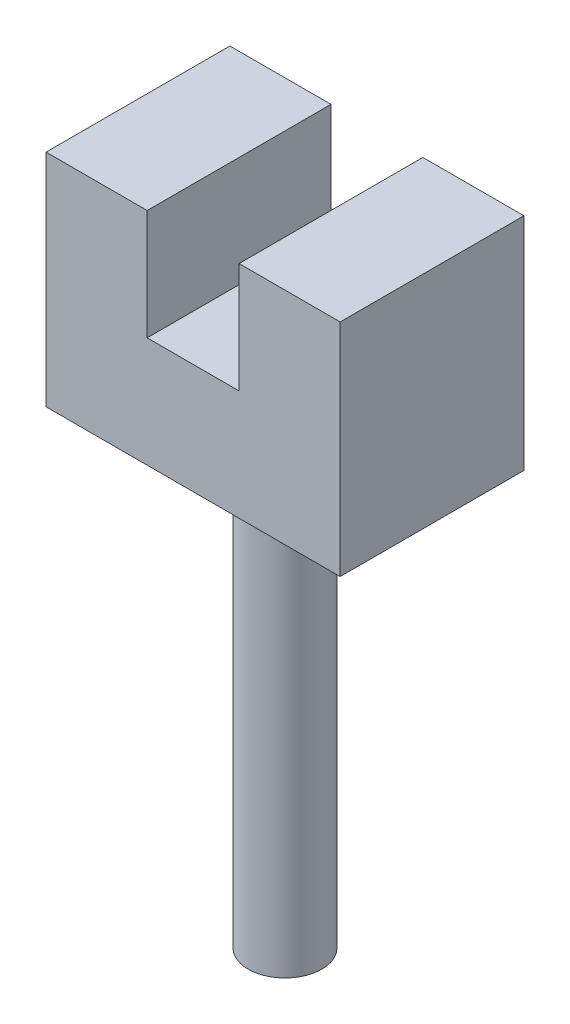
ISO-10303-21;
HEADER;
FILE_DESCRIPTION(('STEP AP214'),'2;1');
FILE_NAME('part.step','',(''),(''),'','','');
FILE_SCHEMA(('AUTOMOTIVE_DESIGN { 1 0 10303 214 1 1 1 1 }'));
ENDSEC;
DATA;
#1=APPLICATION_CONTEXT('core data for automotive mechanical design processes');
#2=APPLICATION_PROTOCOL_DEFINITION('international standard','automotive_design',2000,#1);
#3=PRODUCT_CONTEXT('',#1,'mechanical');
#4=PRODUCT('Part','Part','',(#3));
#5=PRODUCT_RELATED_PRODUCT_CATEGORY('part','',(#4));
#6=PRODUCT_DEFINITION_FORMATION('','',#4);
#7=PRODUCT_DEFINITION_CONTEXT('part definition',#1,'design');
#8=PRODUCT_DEFINITION('design','',#6,#7);
#9=PRODUCT_DEFINITION_SHAPE('','',#8);
#10=(LENGTH_UNIT() NAMED_UNIT(*) SI_UNIT(.MILLI.,.METRE.));
#11=(NAMED_UNIT(*) PLANE_ANGLE_UNIT() SI_UNIT($,.RADIAN.));
#12=(NAMED_UNIT(*) SI_UNIT($,.STERADIAN.) SOLID_ANGLE_UNIT());
#13=UNCERTAINTY_MEASURE_WITH_UNIT(LENGTH_MEASURE(1.E-05),#10,'distance_accuracy_value','');
#14=(GEOMETRIC_REPRESENTATION_CONTEXT(3) GLOBAL_UNCERTAINTY_ASSIGNED_CONTEXT((#13)) GLOBAL_UNIT_ASSIGNED_CONTEXT((#10,
#11,#12)) REPRESENTATION_CONTEXT('',''));
#15=CARTESIAN_POINT('',(0.,0.,0.));
#16=DIRECTION('',(0.,0.,1.));
#17=DIRECTION('',(1.,0.,0.));
#18=AXIS2_PLACEMENT_3D('',#15,#16,#17);
#19=CARTESIAN_POINT('',(0.,-38.1,0.));
#20=DIRECTION('',(0.,0.,1.));
#21=DIRECTION('',(1.,0.,0.));
#22=AXIS2_PLACEMENT_3D('',#19,#20,#21);
#23=PLANE('',#22);
#24=DIRECTION('',(1.,0.,0.));
#25=VECTOR('',#24,1.);
#26=CARTESIAN_POINT('',(0.,0.,0.));
#27=LINE('',#26,#25);
#28=CARTESIAN_POINT('',(33.3375,0.,0.));
#29=VERTEX_POINT('',#28);
#30=CARTESIAN_POINT('',(50.8,0.,0.));
#31=VERTEX_POINT('',#30);
#32=EDGE_CURVE('E138',#29,#31,#27,.T.);
#33=ORIENTED_EDGE('',*,*,#32,.F.);
#34=DIRECTION('',(0.,1.,0.));
#35=VECTOR('',#34,1.);
#36=CARTESIAN_POINT('',(33.3375,-19.05,0.));
#37=LINE('',#36,#35);
#38=CARTESIAN_POINT('',(33.3375,-19.05,0.));
#39=VERTEX_POINT('',#38);
#40=EDGE_CURVE('E136',#39,#29,#37,.T.);
#41=ORIENTED_EDGE('',*,*,#40,.F.);
#42=DIRECTION('',(1.,0.,0.));
#43=VECTOR('',#42,1.);
#44=CARTESIAN_POINT('',(0.,-19.05,0.));
#45=LINE('',#44,#43);
#46=CARTESIAN_POINT('',(17.4625,-19.05,0.));
#47=VERTEX_POINT('',#46);
#48=EDGE_CURVE('E115',#47,#39,#45,.T.);
#49=ORIENTED_EDGE('',*,*,#48,.F.);
#50=DIRECTION('',(0.,1.,0.));
#51=VECTOR('',#50,1.);
#52=CARTESIAN_POINT('',(17.4625,-19.05,0.));
#53=LINE('',#52,#51);
#54=CARTESIAN_POINT('',(17.4625,0.,0.));
#55=VERTEX_POINT('',#54);
#56=EDGE_CURVE('E139',#47,#55,#53,.T.);
#57=ORIENTED_EDGE('',*,*,#56,.T.);
#58=CARTESIAN_POINT('',(0.,0.,0.));
#59=VERTEX_POINT('',#58);
#60=EDGE_CURVE('E152',#59,#55,#27,.T.);
#61=ORIENTED_EDGE('',*,*,#60,.F.);
#62=DIRECTION('',(0.,1.,0.));
#63=VECTOR('',#62,1.);
#64=CARTESIAN_POINT('',(0.,-38.1,0.));
#65=LINE('',#64,#63);
#66=CARTESIAN_POINT('',(0.,-38.1,0.));
#67=VERTEX_POINT('',#66);
#68=EDGE_CURVE('E40',#67,#59,#65,.T.);
#69=ORIENTED_EDGE('',*,*,#68,.F.);
#70=DIRECTION('',(1.,0.,0.));
#71=VECTOR('',#70,1.);
#72=CARTESIAN_POINT('',(0.,-38.1,0.));
#73=LINE('',#72,#71);
#74=CARTESIAN_POINT('',(50.8,-38.1,0.));
#75=VERTEX_POINT('',#74);
#76=EDGE_CURVE('E143',#67,#75,#73,.T.);
#77=ORIENTED_EDGE('',*,*,#76,.T.);
#78=DIRECTION('',(0.,1.,0.));
#79=VECTOR('',#78,1.);
#80=CARTESIAN_POINT('',(50.8,-38.1,0.));
#81=LINE('',#80,#79);
#82=EDGE_CURVE('E81',#75,#31,#81,.T.);
#83=ORIENTED_EDGE('',*,*,#82,.T.);
#84=EDGE_LOOP('',(#33,#41,#49,#57,#61,#69,#77,#83));
#85=FACE_BOUND('',#84,.T.);
#86=ADVANCED_FACE('F33',(#85),#23,.T.);
#87=CARTESIAN_POINT('',(0.,-38.1,-31.75));
#88=DIRECTION('',(0.,0.,1.));
#89=DIRECTION('',(1.,0.,0.));
#90=AXIS2_PLACEMENT_3D('',#87,#88,#89);
#91=PLANE('',#90);
#92=DIRECTION('',(0.,1.,0.));
#93=VECTOR('',#92,1.);
#94=CARTESIAN_POINT('',(33.3375,-19.05,-31.75));
#95=LINE('',#94,#93);
#96=CARTESIAN_POINT('',(33.3375,-19.05,-31.75));
#97=VERTEX_POINT('',#96);
#98=CARTESIAN_POINT('',(33.3375,0.,-31.75));
#99=VERTEX_POINT('',#98);
#100=EDGE_CURVE('E105',#97,#99,#95,.T.);
#101=ORIENTED_EDGE('',*,*,#100,.T.);
#102=DIRECTION('',(1.,0.,0.));
#103=VECTOR('',#102,1.);
#104=CARTESIAN_POINT('',(0.,0.,-31.75));
#105=LINE('',#104,#103);
#106=CARTESIAN_POINT('',(50.8,0.,-31.75));
#107=VERTEX_POINT('',#106);
#108=EDGE_CURVE('E158',#99,#107,#105,.T.);
#109=ORIENTED_EDGE('',*,*,#108,.T.);
#110=DIRECTION('',(0.,1.,0.));
#111=VECTOR('',#110,1.);
#112=CARTESIAN_POINT('',(50.8,-38.1,-31.75));
#113=LINE('',#112,#111);
#114=CARTESIAN_POINT('',(50.8,-38.1,-31.75));
#115=VERTEX_POINT('',#114);
#116=EDGE_CURVE('E166',#115,#107,#113,.T.);
#117=ORIENTED_EDGE('',*,*,#116,.F.);
#118=DIRECTION('',(1.,0.,0.));
#119=VECTOR('',#118,1.);
#120=CARTESIAN_POINT('',(0.,-38.1,-31.75));
#121=LINE('',#120,#119);
#122=CARTESIAN_POINT('',(0.,-38.1,-31.75));
#123=VERTEX_POINT('',#122);
#124=EDGE_CURVE('E148',#123,#115,#121,.T.);
#125=ORIENTED_EDGE('',*,*,#124,.F.);
#126=DIRECTION('',(0.,1.,0.));
#127=VECTOR('',#126,1.);
#128=CARTESIAN_POINT('',(0.,-38.1,-31.75));
#129=LINE('',#128,#127);
#130=CARTESIAN_POINT('',(0.,0.,-31.75));
#131=VERTEX_POINT('',#130);
#132=EDGE_CURVE('E163',#123,#131,#129,.T.);
#133=ORIENTED_EDGE('',*,*,#132,.T.);
#134=CARTESIAN_POINT('',(17.4625,0.,-31.75));
#135=VERTEX_POINT('',#134);
#136=EDGE_CURVE('E159',#131,#135,#105,.T.);
#137=ORIENTED_EDGE('',*,*,#136,.T.);
#138=DIRECTION('',(0.,1.,0.));
#139=VECTOR('',#138,1.);
#140=CARTESIAN_POINT('',(17.4625,-19.05,-31.75));
#141=LINE('',#140,#139);
#142=CARTESIAN_POINT('',(17.4625,-19.05,-31.75));
#143=VERTEX_POINT('',#142);
#144=EDGE_CURVE('E47',#143,#135,#141,.T.);
#145=ORIENTED_EDGE('',*,*,#144,.F.);
#146=DIRECTION('',(1.,0.,0.));
#147=VECTOR('',#146,1.);
#148=CARTESIAN_POINT('',(0.,-19.05,-31.75));
#149=LINE('',#148,#147);
#150=EDGE_CURVE('E120',#143,#97,#149,.T.);
#151=ORIENTED_EDGE('',*,*,#150,.T.);
#152=EDGE_LOOP('',(#101,#109,#117,#125,#133,#137,#145,#151));
#153=FACE_BOUND('',#152,.T.);
#154=ADVANCED_FACE('F125',(#153),#91,.F.);
#155=CARTESIAN_POINT('',(0.,0.,0.));
#156=DIRECTION('',(0.,1.,0.));
#157=DIRECTION('',(0.,0.,1.));
#158=AXIS2_PLACEMENT_3D('',#155,#156,#157);
#159=PLANE('',#158);
#160=ORIENTED_EDGE('',*,*,#108,.F.);
#161=DIRECTION('',(0.,0.,1.));
#162=VECTOR('',#161,1.);
#163=CARTESIAN_POINT('',(33.3375,0.,0.));
#164=LINE('',#163,#162);
#165=EDGE_CURVE('E111',#99,#29,#164,.T.);
#166=ORIENTED_EDGE('',*,*,#165,.T.);
#167=ORIENTED_EDGE('',*,*,#32,.T.);
#168=DIRECTION('',(0.,0.,-1.));
#169=VECTOR('',#168,1.);
#170=CARTESIAN_POINT('',(50.8,0.,0.));
#171=LINE('',#170,#169);
#172=EDGE_CURVE('E155',#31,#107,#171,.T.);
#173=ORIENTED_EDGE('',*,*,#172,.T.);
#174=EDGE_LOOP('',(#160,#166,#167,#173));
#175=FACE_BOUND('',#174,.T.);
#176=ADVANCED_FACE('F173',(#175),#159,.T.);
#177=CARTESIAN_POINT('',(0.,-38.1,0.));
#178=DIRECTION('',(1.,0.,0.));
#179=DIRECTION('',(0.,0.,-1.));
#180=AXIS2_PLACEMENT_3D('',#177,#178,#179);
#181=PLANE('',#180);
#182=DIRECTION('',(0.,0.,-1.));
#183=VECTOR('',#182,1.);
#184=CARTESIAN_POINT('',(0.,0.,0.));
#185=LINE('',#184,#183);
#186=EDGE_CURVE('E146',#59,#131,#185,.T.);
#187=ORIENTED_EDGE('',*,*,#186,.T.);
#188=ORIENTED_EDGE('',*,*,#132,.F.);
#189=DIRECTION('',(0.,0.,-1.));
#190=VECTOR('',#189,1.);
#191=CARTESIAN_POINT('',(0.,-38.1,0.));
#192=LINE('',#191,#190);
#193=EDGE_CURVE('E150',#67,#123,#192,.T.);
#194=ORIENTED_EDGE('',*,*,#193,.F.);
#195=ORIENTED_EDGE('',*,*,#68,.T.);
#196=EDGE_LOOP('',(#187,#188,#194,#195));
#197=FACE_BOUND('',#196,.T.);
#198=ADVANCED_FACE('F178',(#197),#181,.F.);
#199=CARTESIAN_POINT('',(50.8,-38.1,0.));
#200=DIRECTION('',(1.,0.,0.));
#201=DIRECTION('',(0.,0.,-1.));
#202=AXIS2_PLACEMENT_3D('',#199,#200,#201);
#203=PLANE('',#202);
#204=ORIENTED_EDGE('',*,*,#172,.F.);
#205=ORIENTED_EDGE('',*,*,#82,.F.);
#206=DIRECTION('',(0.,0.,-1.));
#207=VECTOR('',#206,1.);
#208=CARTESIAN_POINT('',(50.8,-38.1,0.));
#209=LINE('',#208,#207);
#210=EDGE_CURVE('E145',#75,#115,#209,.T.);
#211=ORIENTED_EDGE('',*,*,#210,.T.);
#212=ORIENTED_EDGE('',*,*,#116,.T.);
#213=EDGE_LOOP('',(#204,#205,#211,#212));
#214=FACE_BOUND('',#213,.T.);
#215=ADVANCED_FACE('F170',(#214),#203,.T.);
#216=CARTESIAN_POINT('',(0.,-38.1,0.));
#217=DIRECTION('',(0.,1.,0.));
#218=DIRECTION('',(0.,0.,1.));
#219=AXIS2_PLACEMENT_3D('',#216,#217,#218);
#220=PLANE('',#219);
#221=CARTESIAN_POINT('',(25.4,-38.1,-15.875));
#222=DIRECTION('',(0.,1.,0.));
#223=DIRECTION('',(0.,0.,1.));
#224=AXIS2_PLACEMENT_3D('',#221,#222,#223);
#225=CIRCLE('',#224,6.35);
#226=CARTESIAN_POINT('',(25.4,-38.1,-9.525));
#227=VERTEX_POINT('',#226);
#228=EDGE_CURVE('E11',#227,#227,#225,.F.);
#229=ORIENTED_EDGE('',*,*,#228,.F.);
#230=EDGE_LOOP('',(#229));
#231=FACE_BOUND('',#230,.T.);
#232=ORIENTED_EDGE('',*,*,#76,.F.);
#233=ORIENTED_EDGE('',*,*,#193,.T.);
#234=ORIENTED_EDGE('',*,*,#124,.T.);
#235=ORIENTED_EDGE('',*,*,#210,.F.);
#236=EDGE_LOOP('',(#232,#233,#234,#235));
#237=FACE_BOUND('',#236,.T.);
#238=ADVANCED_FACE('F176',(#231,#237),#220,.F.);
#239=DIRECTION('',(0.,0.,1.));
#240=VECTOR('',#239,1.);
#241=CARTESIAN_POINT('',(17.4625,0.,0.));
#242=LINE('',#241,#240);
#243=EDGE_CURVE('E123',#135,#55,#242,.T.);
#244=ORIENTED_EDGE('',*,*,#243,.F.);
#245=ORIENTED_EDGE('',*,*,#136,.F.);
#246=ORIENTED_EDGE('',*,*,#186,.F.);
#247=ORIENTED_EDGE('',*,*,#60,.T.);
#248=EDGE_LOOP('',(#244,#245,#246,#247));
#249=FACE_BOUND('',#248,.T.);
#250=ADVANCED_FACE('F181',(#249),#159,.T.);
#251=CARTESIAN_POINT('',(33.3375,-19.05,0.));
#252=DIRECTION('',(-1.,0.,0.));
#253=DIRECTION('',(0.,0.,1.));
#254=AXIS2_PLACEMENT_3D('',#251,#252,#253);
#255=PLANE('',#254);
#256=ORIENTED_EDGE('',*,*,#165,.F.);
#257=ORIENTED_EDGE('',*,*,#100,.F.);
#258=DIRECTION('',(0.,0.,1.));
#259=VECTOR('',#258,1.);
#260=CARTESIAN_POINT('',(33.3375,-19.05,0.));
#261=LINE('',#260,#259);
#262=EDGE_CURVE('E108',#97,#39,#261,.T.);
#263=ORIENTED_EDGE('',*,*,#262,.T.);
#264=ORIENTED_EDGE('',*,*,#40,.T.);
#265=EDGE_LOOP('',(#256,#257,#263,#264));
#266=FACE_BOUND('',#265,.T.);
#267=ADVANCED_FACE('F107',(#266),#255,.T.);
#268=CARTESIAN_POINT('',(17.4625,-19.05,0.));
#269=DIRECTION('',(-1.,0.,0.));
#270=DIRECTION('',(0.,0.,1.));
#271=AXIS2_PLACEMENT_3D('',#268,#269,#270);
#272=PLANE('',#271);
#273=ORIENTED_EDGE('',*,*,#243,.T.);
#274=ORIENTED_EDGE('',*,*,#56,.F.);
#275=DIRECTION('',(0.,0.,1.));
#276=VECTOR('',#275,1.);
#277=CARTESIAN_POINT('',(17.4625,-19.05,0.));
#278=LINE('',#277,#276);
#279=EDGE_CURVE('E127',#143,#47,#278,.T.);
#280=ORIENTED_EDGE('',*,*,#279,.F.);
#281=ORIENTED_EDGE('',*,*,#144,.T.);
#282=EDGE_LOOP('',(#273,#274,#280,#281));
#283=FACE_BOUND('',#282,.T.);
#284=ADVANCED_FACE('F182',(#283),#272,.F.);
#285=CARTESIAN_POINT('',(0.,-19.05,0.));
#286=DIRECTION('',(0.,1.,0.));
#287=DIRECTION('',(0.,0.,1.));
#288=AXIS2_PLACEMENT_3D('',#285,#286,#287);
#289=PLANE('',#288);
#290=ORIENTED_EDGE('',*,*,#262,.F.);
#291=ORIENTED_EDGE('',*,*,#150,.F.);
#292=ORIENTED_EDGE('',*,*,#279,.T.);
#293=ORIENTED_EDGE('',*,*,#48,.T.);
#294=EDGE_LOOP('',(#290,#291,#292,#293));
#295=FACE_BOUND('',#294,.T.);
#296=ADVANCED_FACE('F118',(#295),#289,.T.);
#297=CARTESIAN_POINT('',(25.4,-114.3,-15.875));
#298=DIRECTION('',(0.,1.,0.));
#299=DIRECTION('',(0.,0.,1.));
#300=AXIS2_PLACEMENT_3D('',#297,#298,#299);
#301=CYLINDRICAL_SURFACE('',#300,6.35);
#302=CARTESIAN_POINT('',(25.4,-114.3,-15.875));
#303=DIRECTION('',(0.,-1.,0.));
#304=DIRECTION('',(0.,0.,-1.));
#305=AXIS2_PLACEMENT_3D('',#302,#303,#304);
#306=CIRCLE('',#305,6.35);
#307=CARTESIAN_POINT('',(25.4,-114.3,-9.525));
#308=VERTEX_POINT('',#307);
#309=EDGE_CURVE('E134',#308,#308,#306,.T.);
#310=CARTESIAN_POINT('',(25.4,-114.3,-9.525));
#311=CARTESIAN_POINT('',(25.4,-113.50625,-9.525));
#312=CARTESIAN_POINT('',(25.4,-112.7125,-9.525));
#313=CARTESIAN_POINT('',(25.4,-111.125,-9.525));
#314=CARTESIAN_POINT('',(25.4,-110.33125,-9.525));
#315=CARTESIAN_POINT('',(25.4,-108.74375,-9.525));
#316=CARTESIAN_POINT('',(25.4,-107.95,-9.525));
#317=CARTESIAN_POINT('',(25.4,-106.3625,-9.525));
#318=CARTESIAN_POINT('',(25.4,-105.56875,-9.525));
#319=CARTESIAN_POINT('',(25.4,-103.98125,-9.525));
#320=CARTESIAN_POINT('',(25.4,-103.1875,-9.525));
#321=CARTESIAN_POINT('',(25.4,-101.6,-9.525));
#322=CARTESIAN_POINT('',(25.4,-100.80625,-9.525));
#323=CARTESIAN_POINT('',(25.4,-99.21875,-9.525));
#324=CARTESIAN_POINT('',(25.4,-98.425,-9.525));
#325=CARTESIAN_POINT('',(25.4,-96.8375,-9.525));
#326=CARTESIAN_POINT('',(25.4,-96.04375,-9.525));
#327=CARTESIAN_POINT('',(25.4,-94.45625,-9.525));
#328=CARTESIAN_POINT('',(25.4,-93.6625,-9.525));
#329=CARTESIAN_POINT('',(25.4,-92.075,-9.525));
#330=CARTESIAN_POINT('',(25.4,-91.28125,-9.525));
#331=CARTESIAN_POINT('',(25.4,-89.69375,-9.525));
#332=CARTESIAN_POINT('',(25.4,-88.9,-9.525));
#333=CARTESIAN_POINT('',(25.4,-87.3125,-9.525));
#334=CARTESIAN_POINT('',(25.4,-86.51875,-9.525));
#335=CARTESIAN_POINT('',(25.4,-84.93125,-9.525));
#336=CARTESIAN_POINT('',(25.4,-84.1375,-9.525));
#337=CARTESIAN_POINT('',(25.4,-82.55,-9.525));
#338=CARTESIAN_POINT('',(25.4,-81.75625,-9.525));
#339=CARTESIAN_POINT('',(25.4,-80.16875,-9.525));
#340=CARTESIAN_POINT('',(25.4,-79.375,-9.525));
#341=CARTESIAN_POINT('',(25.4,-77.7875,-9.525));
#342=CARTESIAN_POINT('',(25.4,-76.99375,-9.525));
#343=CARTESIAN_POINT('',(25.4,-75.40625,-9.525));
#344=CARTESIAN_POINT('',(25.4,-74.6125,-9.525));
#345=CARTESIAN_POINT('',(25.4,-73.025,-9.525));
#346=CARTESIAN_POINT('',(25.4,-72.23125,-9.525));
#347=CARTESIAN_POINT('',(25.4,-70.64375,-9.525));
#348=CARTESIAN_POINT('',(25.4,-69.85,-9.525));
#349=CARTESIAN_POINT('',(25.4,-68.2625,-9.525));
#350=CARTESIAN_POINT('',(25.4,-67.46875,-9.525));
#351=CARTESIAN_POINT('',(25.4,-65.88125,-9.525));
#352=CARTESIAN_POINT('',(25.4,-65.0875,-9.525));
#353=CARTESIAN_POINT('',(25.4,-63.5,-9.525));
#354=CARTESIAN_POINT('',(25.4,-62.70625,-9.525));
#355=CARTESIAN_POINT('',(25.4,-61.11875,-9.525));
#356=CARTESIAN_POINT('',(25.4,-60.325,-9.525));
#357=CARTESIAN_POINT('',(25.4,-58.7375,-9.525));
#358=CARTESIAN_POINT('',(25.4,-57.94375,-9.525));
#359=CARTESIAN_POINT('',(25.4,-56.35625,-9.525));
#360=CARTESIAN_POINT('',(25.4,-55.5625,-9.525));
#361=CARTESIAN_POINT('',(25.4,-53.975,-9.525));
#362=CARTESIAN_POINT('',(25.4,-53.18125,-9.525));
#363=CARTESIAN_POINT('',(25.4,-51.59375,-9.525));
#364=CARTESIAN_POINT('',(25.4,-50.8,-9.525));
#365=CARTESIAN_POINT('',(25.4,-49.2125,-9.525));
#366=CARTESIAN_POINT('',(25.4,-48.41875,-9.525));
#367=CARTESIAN_POINT('',(25.4,-46.83125,-9.525));
#368=CARTESIAN_POINT('',(25.4,-46.0375,-9.525));
#369=CARTESIAN_POINT('',(25.4,-44.45,-9.525));
#370=CARTESIAN_POINT('',(25.4,-43.65625,-9.525));
#371=CARTESIAN_POINT('',(25.4,-42.06875,-9.525));
#372=CARTESIAN_POINT('',(25.4,-41.275,-9.525));
#373=CARTESIAN_POINT('',(25.4,-39.6875,-9.525));
#374=CARTESIAN_POINT('',(25.4,-38.89375,-9.525));
#375=CARTESIAN_POINT('',(25.4,-38.1,-9.525));
#376=B_SPLINE_CURVE_WITH_KNOTS('',3,(#310,#311,#312,#313,#314,#315,#316,#317,#318,#319,#320,
#321,#322,#323,#324,#325,#326,#327,#328,#329,#330,#331,#332,#333,#334,#335,#336,#337,#338,#339,
#340,#341,#342,#343,#344,#345,#346,#347,#348,#349,#350,#351,#352,#353,#354,#355,#356,#357,#358,
#359,#360,#361,#362,#363,#364,#365,#366,#367,#368,#369,#370,#371,#372,#373,#374,#375),
.UNSPECIFIED.,.F.,.F.,(4,2,2,2,2,2,2,2,2,2,2,2,2,2,2,2,2,2,2,2,2,2,2,2,2,2,2,2,2,2,2,2,4),(0.,
2.38124999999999,4.76249999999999,7.14374999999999,9.52499999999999,11.90625,14.2875,16.66875,
19.05,21.43125,23.8125,26.19375,28.575,30.95625,33.3375,35.71875,38.1,40.48125,42.8625,45.24375,
47.625,50.00625,52.3875,54.76875,57.15,59.53125,61.9125,64.29375,66.675,69.05625,71.4375,
73.81875,76.2),.UNSPECIFIED.);
#377=EDGE_CURVE('BSEAM189',#308,#227,#376,.T.);
#378=ORIENTED_EDGE('',*,*,#309,.F.);
#379=ORIENTED_EDGE('',*,*,#228,.T.);
#380=ORIENTED_EDGE('',*,*,#377,.T.);
#381=ORIENTED_EDGE('',*,*,#377,.F.);
#382=EDGE_LOOP('',(#378,#380,#379,#381));
#383=FACE_BOUND('',#382,.T.);
#384=ADVANCED_FACE('F189',(#383),#301,.T.);
#385=CARTESIAN_POINT('',(25.4,-114.3,-15.875));
#386=DIRECTION('',(0.,-1.,0.));
#387=DIRECTION('',(0.,0.,-1.));
#388=AXIS2_PLACEMENT_3D('',#385,#386,#387);
#389=PLANE('',#388);
#390=ORIENTED_EDGE('',*,*,#309,.T.);
#391=EDGE_LOOP('',(#390));
#392=FACE_BOUND('',#391,.T.);
#393=ADVANCED_FACE('F262',(#392),#389,.T.);
#394=CLOSED_SHELL('',(#86,#154,#176,#198,#215,#238,#250,#267,#284,#296,#384,#393));
#395=MANIFOLD_SOLID_BREP('B2',#394);
#396=ADVANCED_BREP_SHAPE_REPRESENTATION('',(#18,#395),#14);
#397=SHAPE_DEFINITION_REPRESENTATION(#9,#396);
ENDSEC;
END-ISO-10303-21;
